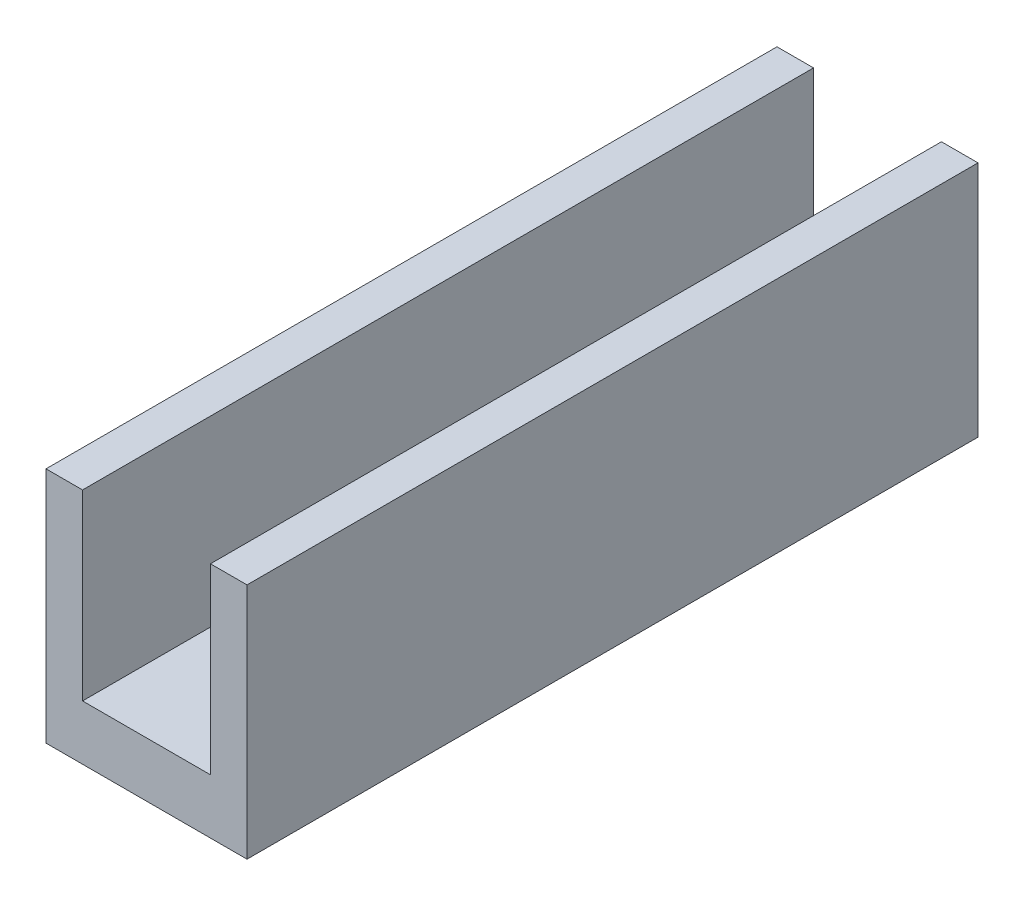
ISO-10303-21;
HEADER;
FILE_DESCRIPTION(('STEP AP214'),'2;1');
FILE_NAME('part.step','',(''),(''),'','','');
FILE_SCHEMA(('AUTOMOTIVE_DESIGN { 1 0 10303 214 1 1 1 1 }'));
ENDSEC;
DATA;
#1=APPLICATION_CONTEXT('core data for automotive mechanical design processes');
#2=APPLICATION_PROTOCOL_DEFINITION('international standard','automotive_design',2000,#1);
#3=PRODUCT_CONTEXT('',#1,'mechanical');
#4=PRODUCT('Part','Part','',(#3));
#5=PRODUCT_RELATED_PRODUCT_CATEGORY('part','',(#4));
#6=PRODUCT_DEFINITION_FORMATION('','',#4);
#7=PRODUCT_DEFINITION_CONTEXT('part definition',#1,'design');
#8=PRODUCT_DEFINITION('design','',#6,#7);
#9=PRODUCT_DEFINITION_SHAPE('','',#8);
#10=(LENGTH_UNIT() NAMED_UNIT(*) SI_UNIT(.MILLI.,.METRE.));
#11=(NAMED_UNIT(*) PLANE_ANGLE_UNIT() SI_UNIT($,.RADIAN.));
#12=(NAMED_UNIT(*) SI_UNIT($,.STERADIAN.) SOLID_ANGLE_UNIT());
#13=UNCERTAINTY_MEASURE_WITH_UNIT(LENGTH_MEASURE(1.E-05),#10,'distance_accuracy_value','');
#14=(GEOMETRIC_REPRESENTATION_CONTEXT(3) GLOBAL_UNCERTAINTY_ASSIGNED_CONTEXT((#13)) GLOBAL_UNIT_ASSIGNED_CONTEXT((#10,
#11,#12)) REPRESENTATION_CONTEXT('',''));
#15=CARTESIAN_POINT('',(0.,0.,0.));
#16=DIRECTION('',(0.,0.,1.));
#17=DIRECTION('',(1.,0.,0.));
#18=AXIS2_PLACEMENT_3D('',#15,#16,#17);
#19=CARTESIAN_POINT('',(11.,20.,80.));
#20=DIRECTION('',(0.,-1.,0.));
#21=DIRECTION('',(1.,0.,0.));
#22=AXIS2_PLACEMENT_3D('',#19,#20,#21);
#23=PLANE('',#22);
#24=DIRECTION('',(-1.,0.,0.));
#25=VECTOR('',#24,1.);
#26=CARTESIAN_POINT('',(11.,20.,0.));
#27=LINE('',#26,#25);
#28=CARTESIAN_POINT('',(11.,20.,0.));
#29=VERTEX_POINT('',#28);
#30=CARTESIAN_POINT('',(7.,20.,0.));
#31=VERTEX_POINT('',#30);
#32=EDGE_CURVE('E129',#29,#31,#27,.T.);
#33=ORIENTED_EDGE('',*,*,#32,.T.);
#34=DIRECTION('',(0.,0.,-1.));
#35=VECTOR('',#34,1.);
#36=CARTESIAN_POINT('',(7.,20.,80.));
#37=LINE('',#36,#35);
#38=CARTESIAN_POINT('',(7.,20.,80.));
#39=VERTEX_POINT('',#38);
#40=EDGE_CURVE('E11',#39,#31,#37,.T.);
#41=ORIENTED_EDGE('',*,*,#40,.F.);
#42=DIRECTION('',(-1.,0.,0.));
#43=VECTOR('',#42,1.);
#44=CARTESIAN_POINT('',(11.,20.,80.));
#45=LINE('',#44,#43);
#46=CARTESIAN_POINT('',(11.,20.,80.));
#47=VERTEX_POINT('',#46);
#48=EDGE_CURVE('E143',#47,#39,#45,.T.);
#49=ORIENTED_EDGE('',*,*,#48,.F.);
#50=DIRECTION('',(0.,0.,-1.));
#51=VECTOR('',#50,1.);
#52=CARTESIAN_POINT('',(11.,20.,80.));
#53=LINE('',#52,#51);
#54=EDGE_CURVE('E125',#47,#29,#53,.T.);
#55=ORIENTED_EDGE('',*,*,#54,.T.);
#56=EDGE_LOOP('',(#33,#41,#49,#55));
#57=FACE_BOUND('',#56,.T.);
#58=ADVANCED_FACE('F33',(#57),#23,.F.);
#59=CARTESIAN_POINT('',(7.,20.,80.));
#60=DIRECTION('',(1.,0.,0.));
#61=DIRECTION('',(0.,1.,0.));
#62=AXIS2_PLACEMENT_3D('',#59,#60,#61);
#63=PLANE('',#62);
#64=DIRECTION('',(0.,-1.,0.));
#65=VECTOR('',#64,1.);
#66=CARTESIAN_POINT('',(7.,20.,0.));
#67=LINE('',#66,#65);
#68=CARTESIAN_POINT('',(7.,0.,0.));
#69=VERTEX_POINT('',#68);
#70=EDGE_CURVE('E132',#31,#69,#67,.T.);
#71=ORIENTED_EDGE('',*,*,#70,.T.);
#72=DIRECTION('',(0.,0.,-1.));
#73=VECTOR('',#72,1.);
#74=CARTESIAN_POINT('',(7.,0.,80.));
#75=LINE('',#74,#73);
#76=CARTESIAN_POINT('',(7.,0.,80.));
#77=VERTEX_POINT('',#76);
#78=EDGE_CURVE('E41',#77,#69,#75,.T.);
#79=ORIENTED_EDGE('',*,*,#78,.F.);
#80=DIRECTION('',(0.,-1.,0.));
#81=VECTOR('',#80,1.);
#82=CARTESIAN_POINT('',(7.,20.,80.));
#83=LINE('',#82,#81);
#84=EDGE_CURVE('E92',#39,#77,#83,.T.);
#85=ORIENTED_EDGE('',*,*,#84,.F.);
#86=ORIENTED_EDGE('',*,*,#40,.T.);
#87=EDGE_LOOP('',(#71,#79,#85,#86));
#88=FACE_BOUND('',#87,.T.);
#89=ADVANCED_FACE('F178',(#88),#63,.F.);
#90=CARTESIAN_POINT('',(7.,0.,80.));
#91=DIRECTION('',(0.,-1.,0.));
#92=DIRECTION('',(0.,0.,-1.));
#93=AXIS2_PLACEMENT_3D('',#90,#91,#92);
#94=PLANE('',#93);
#95=DIRECTION('',(-1.,0.,0.));
#96=VECTOR('',#95,1.);
#97=CARTESIAN_POINT('',(7.,0.,0.));
#98=LINE('',#97,#96);
#99=CARTESIAN_POINT('',(-7.,0.,0.));
#100=VERTEX_POINT('',#99);
#101=EDGE_CURVE('E134',#69,#100,#98,.T.);
#102=ORIENTED_EDGE('',*,*,#101,.T.);
#103=DIRECTION('',(0.,0.,-1.));
#104=VECTOR('',#103,1.);
#105=CARTESIAN_POINT('',(-7.,0.,80.));
#106=LINE('',#105,#104);
#107=CARTESIAN_POINT('',(-7.,0.,80.));
#108=VERTEX_POINT('',#107);
#109=EDGE_CURVE('E150',#108,#100,#106,.T.);
#110=ORIENTED_EDGE('',*,*,#109,.F.);
#111=DIRECTION('',(-1.,0.,0.));
#112=VECTOR('',#111,1.);
#113=CARTESIAN_POINT('',(7.,0.,80.));
#114=LINE('',#113,#112);
#115=EDGE_CURVE('E158',#77,#108,#114,.T.);
#116=ORIENTED_EDGE('',*,*,#115,.F.);
#117=ORIENTED_EDGE('',*,*,#78,.T.);
#118=EDGE_LOOP('',(#102,#110,#116,#117));
#119=FACE_BOUND('',#118,.T.);
#120=ADVANCED_FACE('F156',(#119),#94,.F.);
#121=CARTESIAN_POINT('',(-7.,20.,80.));
#122=DIRECTION('',(-1.,0.,0.));
#123=DIRECTION('',(0.,-1.,0.));
#124=AXIS2_PLACEMENT_3D('',#121,#122,#123);
#125=PLANE('',#124);
#126=DIRECTION('',(0.,1.,0.));
#127=VECTOR('',#126,1.);
#128=CARTESIAN_POINT('',(-7.,20.,0.));
#129=LINE('',#128,#127);
#130=CARTESIAN_POINT('',(-7.,20.,0.));
#131=VERTEX_POINT('',#130);
#132=EDGE_CURVE('E136',#100,#131,#129,.T.);
#133=ORIENTED_EDGE('',*,*,#132,.T.);
#134=DIRECTION('',(0.,0.,-1.));
#135=VECTOR('',#134,1.);
#136=CARTESIAN_POINT('',(-7.,20.,80.));
#137=LINE('',#136,#135);
#138=CARTESIAN_POINT('',(-7.,20.,80.));
#139=VERTEX_POINT('',#138);
#140=EDGE_CURVE('E147',#139,#131,#137,.T.);
#141=ORIENTED_EDGE('',*,*,#140,.F.);
#142=DIRECTION('',(0.,1.,0.));
#143=VECTOR('',#142,1.);
#144=CARTESIAN_POINT('',(-7.,20.,80.));
#145=LINE('',#144,#143);
#146=EDGE_CURVE('E170',#108,#139,#145,.T.);
#147=ORIENTED_EDGE('',*,*,#146,.F.);
#148=ORIENTED_EDGE('',*,*,#109,.T.);
#149=EDGE_LOOP('',(#133,#141,#147,#148));
#150=FACE_BOUND('',#149,.T.);
#151=ADVANCED_FACE('F166',(#150),#125,.F.);
#152=CARTESIAN_POINT('',(-11.,20.,80.));
#153=DIRECTION('',(0.,-1.,0.));
#154=DIRECTION('',(1.,0.,0.));
#155=AXIS2_PLACEMENT_3D('',#152,#153,#154);
#156=PLANE('',#155);
#157=DIRECTION('',(-1.,0.,0.));
#158=VECTOR('',#157,1.);
#159=CARTESIAN_POINT('',(-11.,20.,0.));
#160=LINE('',#159,#158);
#161=CARTESIAN_POINT('',(-11.,20.,0.));
#162=VERTEX_POINT('',#161);
#163=EDGE_CURVE('E138',#131,#162,#160,.T.);
#164=ORIENTED_EDGE('',*,*,#163,.T.);
#165=DIRECTION('',(0.,0.,-1.));
#166=VECTOR('',#165,1.);
#167=CARTESIAN_POINT('',(-11.,20.,80.));
#168=LINE('',#167,#166);
#169=CARTESIAN_POINT('',(-11.,20.,80.));
#170=VERTEX_POINT('',#169);
#171=EDGE_CURVE('E120',#170,#162,#168,.T.);
#172=ORIENTED_EDGE('',*,*,#171,.F.);
#173=DIRECTION('',(-1.,0.,0.));
#174=VECTOR('',#173,1.);
#175=CARTESIAN_POINT('',(-11.,20.,80.));
#176=LINE('',#175,#174);
#177=EDGE_CURVE('E111',#139,#170,#176,.T.);
#178=ORIENTED_EDGE('',*,*,#177,.F.);
#179=ORIENTED_EDGE('',*,*,#140,.T.);
#180=EDGE_LOOP('',(#164,#172,#178,#179));
#181=FACE_BOUND('',#180,.T.);
#182=ADVANCED_FACE('F169',(#181),#156,.F.);
#183=CARTESIAN_POINT('',(-11.,-6.,80.));
#184=DIRECTION('',(1.,0.,0.));
#185=DIRECTION('',(0.,0.,-1.));
#186=AXIS2_PLACEMENT_3D('',#183,#184,#185);
#187=PLANE('',#186);
#188=DIRECTION('',(0.,-1.,0.));
#189=VECTOR('',#188,1.);
#190=CARTESIAN_POINT('',(-11.,-6.,0.));
#191=LINE('',#190,#189);
#192=CARTESIAN_POINT('',(-11.,-6.,0.));
#193=VERTEX_POINT('',#192);
#194=EDGE_CURVE('E119',#162,#193,#191,.T.);
#195=ORIENTED_EDGE('',*,*,#194,.T.);
#196=DIRECTION('',(0.,0.,-1.));
#197=VECTOR('',#196,1.);
#198=CARTESIAN_POINT('',(-11.,-6.,80.));
#199=LINE('',#198,#197);
#200=CARTESIAN_POINT('',(-11.,-6.,80.));
#201=VERTEX_POINT('',#200);
#202=EDGE_CURVE('E116',#201,#193,#199,.T.);
#203=ORIENTED_EDGE('',*,*,#202,.F.);
#204=DIRECTION('',(0.,-1.,0.));
#205=VECTOR('',#204,1.);
#206=CARTESIAN_POINT('',(-11.,-6.,80.));
#207=LINE('',#206,#205);
#208=EDGE_CURVE('E105',#170,#201,#207,.T.);
#209=ORIENTED_EDGE('',*,*,#208,.F.);
#210=ORIENTED_EDGE('',*,*,#171,.T.);
#211=EDGE_LOOP('',(#195,#203,#209,#210));
#212=FACE_BOUND('',#211,.T.);
#213=ADVANCED_FACE('F117',(#212),#187,.F.);
#214=CARTESIAN_POINT('',(-11.,-6.,80.));
#215=DIRECTION('',(0.,1.,0.));
#216=DIRECTION('',(0.,0.,1.));
#217=AXIS2_PLACEMENT_3D('',#214,#215,#216);
#218=PLANE('',#217);
#219=DIRECTION('',(1.,0.,0.));
#220=VECTOR('',#219,1.);
#221=CARTESIAN_POINT('',(-11.,-6.,0.));
#222=LINE('',#221,#220);
#223=CARTESIAN_POINT('',(11.,-6.,0.));
#224=VERTEX_POINT('',#223);
#225=EDGE_CURVE('E78',#193,#224,#222,.T.);
#226=ORIENTED_EDGE('',*,*,#225,.T.);
#227=DIRECTION('',(0.,0.,-1.));
#228=VECTOR('',#227,1.);
#229=CARTESIAN_POINT('',(11.,-6.,80.));
#230=LINE('',#229,#228);
#231=CARTESIAN_POINT('',(11.,-6.,80.));
#232=VERTEX_POINT('',#231);
#233=EDGE_CURVE('E121',#232,#224,#230,.T.);
#234=ORIENTED_EDGE('',*,*,#233,.F.);
#235=DIRECTION('',(1.,0.,0.));
#236=VECTOR('',#235,1.);
#237=CARTESIAN_POINT('',(-11.,-6.,80.));
#238=LINE('',#237,#236);
#239=EDGE_CURVE('E109',#201,#232,#238,.T.);
#240=ORIENTED_EDGE('',*,*,#239,.F.);
#241=ORIENTED_EDGE('',*,*,#202,.T.);
#242=EDGE_LOOP('',(#226,#234,#240,#241));
#243=FACE_BOUND('',#242,.T.);
#244=ADVANCED_FACE('F123',(#243),#218,.F.);
#245=CARTESIAN_POINT('',(11.,-6.,80.));
#246=DIRECTION('',(-1.,0.,0.));
#247=DIRECTION('',(0.,0.,1.));
#248=AXIS2_PLACEMENT_3D('',#245,#246,#247);
#249=PLANE('',#248);
#250=DIRECTION('',(0.,1.,0.));
#251=VECTOR('',#250,1.);
#252=CARTESIAN_POINT('',(11.,-6.,0.));
#253=LINE('',#252,#251);
#254=EDGE_CURVE('E84',#224,#29,#253,.T.);
#255=ORIENTED_EDGE('',*,*,#254,.T.);
#256=ORIENTED_EDGE('',*,*,#54,.F.);
#257=DIRECTION('',(0.,1.,0.));
#258=VECTOR('',#257,1.);
#259=CARTESIAN_POINT('',(11.,-6.,80.));
#260=LINE('',#259,#258);
#261=EDGE_CURVE('E49',#232,#47,#260,.T.);
#262=ORIENTED_EDGE('',*,*,#261,.F.);
#263=ORIENTED_EDGE('',*,*,#233,.T.);
#264=EDGE_LOOP('',(#255,#256,#262,#263));
#265=FACE_BOUND('',#264,.T.);
#266=ADVANCED_FACE('F194',(#265),#249,.F.);
#267=CARTESIAN_POINT('',(0.,0.,80.));
#268=DIRECTION('',(0.,0.,1.));
#269=DIRECTION('',(1.,0.,0.));
#270=AXIS2_PLACEMENT_3D('',#267,#268,#269);
#271=PLANE('',#270);
#272=ORIENTED_EDGE('',*,*,#48,.T.);
#273=ORIENTED_EDGE('',*,*,#84,.T.);
#274=ORIENTED_EDGE('',*,*,#115,.T.);
#275=ORIENTED_EDGE('',*,*,#146,.T.);
#276=ORIENTED_EDGE('',*,*,#177,.T.);
#277=ORIENTED_EDGE('',*,*,#208,.T.);
#278=ORIENTED_EDGE('',*,*,#239,.T.);
#279=ORIENTED_EDGE('',*,*,#261,.T.);
#280=EDGE_LOOP('',(#272,#273,#274,#275,#276,#277,#278,#279));
#281=FACE_BOUND('',#280,.T.);
#282=ADVANCED_FACE('F107',(#281),#271,.T.);
#283=CARTESIAN_POINT('',(0.,0.,0.));
#284=DIRECTION('',(0.,0.,1.));
#285=DIRECTION('',(1.,0.,0.));
#286=AXIS2_PLACEMENT_3D('',#283,#284,#285);
#287=PLANE('',#286);
#288=ORIENTED_EDGE('',*,*,#32,.F.);
#289=ORIENTED_EDGE('',*,*,#254,.F.);
#290=ORIENTED_EDGE('',*,*,#225,.F.);
#291=ORIENTED_EDGE('',*,*,#194,.F.);
#292=ORIENTED_EDGE('',*,*,#163,.F.);
#293=ORIENTED_EDGE('',*,*,#132,.F.);
#294=ORIENTED_EDGE('',*,*,#101,.F.);
#295=ORIENTED_EDGE('',*,*,#70,.F.);
#296=EDGE_LOOP('',(#288,#289,#290,#291,#292,#293,#294,#295));
#297=FACE_BOUND('',#296,.T.);
#298=ADVANCED_FACE('F162',(#297),#287,.F.);
#299=CLOSED_SHELL('',(#58,#89,#120,#151,#182,#213,#244,#266,#282,#298));
#300=MANIFOLD_SOLID_BREP('B2',#299);
#301=ADVANCED_BREP_SHAPE_REPRESENTATION('',(#18,#300),#14);
#302=SHAPE_DEFINITION_REPRESENTATION(#9,#301);
ENDSEC;
END-ISO-10303-21;
